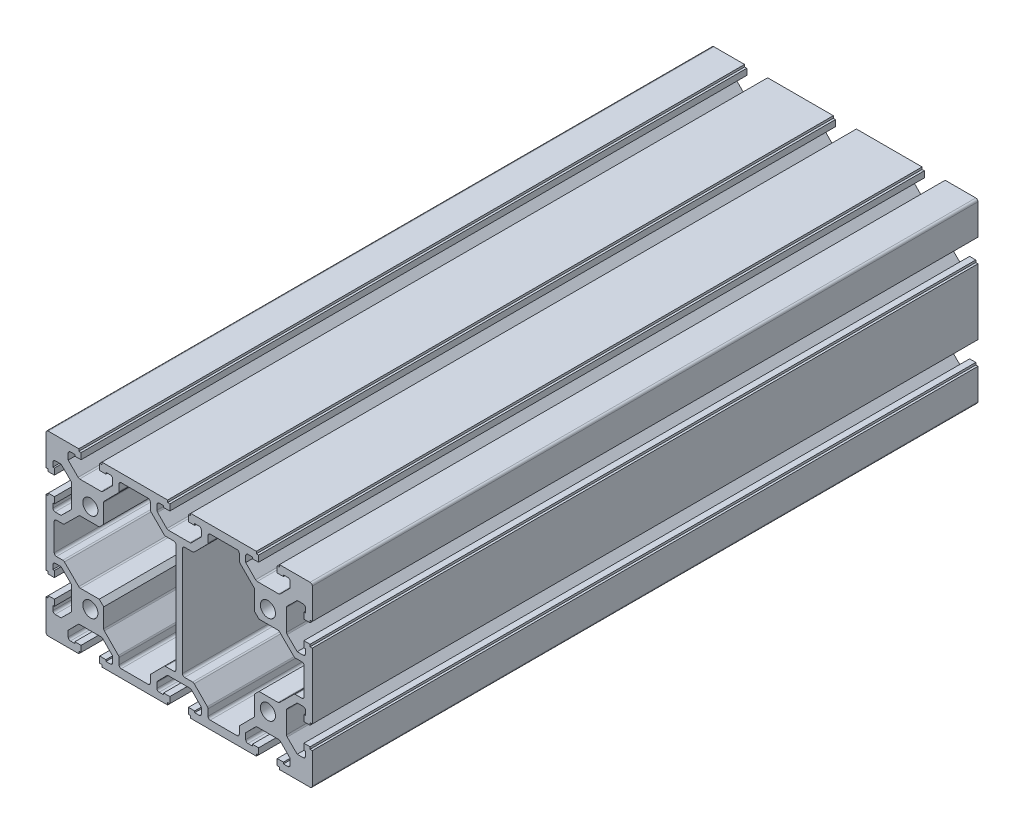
from build123d import *

# Parameters (mm, degrees)
MODEL_R         = 3.4
EXTRUDE_1_DEPTH = 300


with BuildPart() as part:
    # Model → Extrude 1 (new body)
    with BuildSketch(Plane.XY):
        with BuildLine():
            Line((1924.335469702, 1988.284523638), (1929.168185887, 1988.284523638))
            Line((1929.168185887, 1988.284523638), (1934.000902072, 1988.284523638))
            ThreePointArc((1934.000902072, 1988.284523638), (1934.386002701, 1988.207398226), (1934.711701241, 1987.987918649))
            Line((1934.711701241, 1987.987918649), (1938.878985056, 1983.776768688))
            ThreePointArc((1938.878985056, 1983.776768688), (1939.093064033, 1983.45363729), (1939.168185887, 1983.073373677))
            Line((1939.168185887, 1983.073373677), (1939.168185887, 1980.784523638))
            ThreePointArc((1939.168185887, 1980.784523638), (1938.875292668, 1980.077416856), (1938.168185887, 1979.784523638))
            Line((1938.168185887, 1979.784523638), (1936.168185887, 1979.784523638))
            Line((1936.168185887, 1979.784523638), (1936.168185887, 1980.484523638))
            Line((1936.168185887, 1980.484523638), (1933.368185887, 1980.484523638))
            Line((1933.368185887, 1980.484523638), (1933.368185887, 1977.684523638))
            Line((1933.368185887, 1977.684523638), (1934.368185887, 1977.684523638))
            Line((1934.368185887, 1977.684523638), (1934.368185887, 1976.684523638))
            Line((1934.368185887, 1976.684523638), (1963.968185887, 1976.684523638))
            Line((1963.968185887, 1976.684523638), (1963.968185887, 1977.684523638))
            Line((1963.968185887, 1977.684523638), (1964.968185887, 1977.684523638))
            Line((1964.968185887, 1977.684523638), (1964.968185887, 1980.484523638))
            Line((1964.968185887, 1980.484523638), (1962.168185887, 1980.484523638))
            Line((1962.168185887, 1980.484523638), (1962.168185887, 1979.784523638))
            Line((1962.168185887, 1979.784523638), (1960.168185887, 1979.784523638))
            ThreePointArc((1960.168185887, 1979.784523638), (1959.461079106, 1980.077416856), (1959.168185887, 1980.784523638))
            Line((1959.168185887, 1980.784523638), (1959.168185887, 1983.484523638))
            Line((1959.168185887, 1983.484523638), (1963.624670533, 1987.987918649))
            ThreePointArc((1963.624670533, 1987.987918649), (1963.950369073, 1988.207398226), (1964.335469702, 1988.284523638))
            Line((1964.335469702, 1988.284523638), (1969.168185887, 1988.284523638))
            Line((1969.168185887, 1988.284523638), (1974.000902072, 1988.284523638))
            ThreePointArc((1974.000902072, 1988.284523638), (1974.386002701, 1988.207398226), (1974.711701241, 1987.987918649))
            Line((1974.711701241, 1987.987918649), (1979.168185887, 1983.484523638))
            Line((1979.168185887, 1983.484523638), (1979.168185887, 1980.784523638))
            ThreePointArc((1979.168185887, 1980.784523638), (1978.875292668, 1980.077416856), (1978.168185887, 1979.784523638))
            Line((1978.168185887, 1979.784523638), (1976.168185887, 1979.784523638))
            Line((1976.168185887, 1979.784523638), (1976.168185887, 1980.484523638))
            Line((1976.168185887, 1980.484523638), (1973.368185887, 1980.484523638))
            Line((1973.368185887, 1980.484523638), (1973.368185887, 1977.684523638))
            Line((1973.368185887, 1977.684523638), (1974.368185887, 1977.684523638))
            Line((1974.368185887, 1977.684523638), (1974.368185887, 1976.684523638))
            Line((1974.368185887, 1976.684523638), (1988.168185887, 1976.684523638))
            ThreePointArc((1988.168185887, 1976.684523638), (1988.875292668, 1976.977416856), (1989.168185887, 1977.684523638))
            Line((1989.168185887, 1977.684523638), (1989.168185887, 1991.484523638))
            Line((1989.168185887, 1991.484523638), (1988.168185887, 1991.484523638))
            Line((1988.168185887, 1991.484523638), (1988.168185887, 1992.484523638))
            Line((1988.168185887, 1992.484523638), (1985.368185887, 1992.484523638))
            Line((1985.368185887, 1992.484523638), (1985.368185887, 1989.684523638))
            Line((1985.368185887, 1989.684523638), (1986.068185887, 1989.684523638))
            Line((1986.068185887, 1989.684523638), (1986.068185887, 1987.684523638))
            ThreePointArc((1986.068185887, 1987.684523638), (1985.775292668, 1986.977416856), (1985.068185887, 1986.684523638))
            Line((1985.068185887, 1986.684523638), (1982.368185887, 1986.684523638))
            Line((1982.368185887, 1986.684523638), (1977.864790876, 1991.141008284))
            ThreePointArc((1977.864790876, 1991.141008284), (1977.645311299, 1991.466706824), (1977.568185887, 1991.851807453))
            Line((1977.568185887, 1991.851807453), (1977.568185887, 1996.684523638))
            Line((1977.568185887, 1996.684523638), (1977.568185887, 2001.517239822))
            ThreePointArc((1977.568185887, 2001.517239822), (1977.645311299, 2001.902340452), (1977.864790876, 2002.228038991))
            Line((1977.864790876, 2002.228038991), (1982.368185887, 2006.684523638))
            Line((1982.368185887, 2006.684523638), (1985.068185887, 2006.684523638))
            ThreePointArc((1985.068185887, 2006.684523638), (1985.775292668, 2006.391630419), (1986.068185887, 2005.684523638))
            Line((1986.068185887, 2005.684523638), (1986.068185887, 2003.684523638))
            Line((1986.068185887, 2003.684523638), (1985.368185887, 2003.684523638))
            Line((1985.368185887, 2003.684523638), (1985.368185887, 2000.884523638))
            Line((1985.368185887, 2000.884523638), (1988.168185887, 2000.884523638))
            Line((1988.168185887, 2000.884523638), (1988.168185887, 2001.884523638))
            Line((1988.168185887, 2001.884523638), (1989.168185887, 2001.884523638))
            Line((1989.168185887, 2001.884523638), (1989.168185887, 2016.684523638))
            Line((1989.168185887, 2016.684523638), (1989.168185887, 2031.484523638))
            Line((1989.168185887, 2031.484523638), (1988.168185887, 2031.484523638))
            Line((1988.168185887, 2031.484523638), (1988.168185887, 2032.484523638))
            Line((1988.168185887, 2032.484523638), (1985.368185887, 2032.484523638))
            Line((1985.368185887, 2032.484523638), (1985.368185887, 2029.684523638))
            Line((1985.368185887, 2029.684523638), (1986.068185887, 2029.684523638))
            Line((1986.068185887, 2029.684523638), (1986.068185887, 2027.684523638))
            ThreePointArc((1986.068185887, 2027.684523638), (1985.775292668, 2026.977416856), (1985.068185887, 2026.684523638))
            Line((1985.068185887, 2026.684523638), (1982.368185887, 2026.684523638))
            Line((1982.368185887, 2026.684523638), (1977.864790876, 2031.141008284))
            ThreePointArc((1977.864790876, 2031.141008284), (1977.645311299, 2031.466706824), (1977.568185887, 2031.851807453))
            Line((1977.568185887, 2031.851807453), (1977.568185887, 2036.684523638))
            Line((1977.568185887, 2036.684523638), (1977.568185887, 2041.517239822))
            ThreePointArc((1977.568185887, 2041.517239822), (1977.645311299, 2041.902340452), (1977.864790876, 2042.228038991))
            Line((1977.864790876, 2042.228038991), (1982.368185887, 2046.684523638))
            Line((1982.368185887, 2046.684523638), (1985.068185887, 2046.684523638))
            ThreePointArc((1985.068185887, 2046.684523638), (1985.775292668, 2046.391630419), (1986.068185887, 2045.684523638))
            Line((1986.068185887, 2045.684523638), (1986.068185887, 2043.684523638))
            Line((1986.068185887, 2043.684523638), (1985.368185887, 2043.684523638))
            Line((1985.368185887, 2043.684523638), (1985.368185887, 2040.884523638))
            Line((1985.368185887, 2040.884523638), (1988.168185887, 2040.884523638))
            Line((1988.168185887, 2040.884523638), (1988.168185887, 2041.884523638))
            Line((1988.168185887, 2041.884523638), (1989.168185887, 2041.884523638))
            Line((1989.168185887, 2041.884523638), (1989.168185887, 2055.684523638))
            ThreePointArc((1989.168185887, 2055.684523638), (1988.875292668, 2056.391630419), (1988.168185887, 2056.684523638))
            Line((1988.168185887, 2056.684523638), (1974.368185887, 2056.684523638))
            Line((1974.368185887, 2056.684523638), (1974.368185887, 2055.684523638))
            Line((1974.368185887, 2055.684523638), (1973.368185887, 2055.684523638))
            Line((1973.368185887, 2055.684523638), (1973.368185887, 2052.884523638))
            Line((1973.368185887, 2052.884523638), (1976.168185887, 2052.884523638))
            Line((1976.168185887, 2052.884523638), (1976.168185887, 2053.584523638))
            Line((1976.168185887, 2053.584523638), (1978.168185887, 2053.584523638))
            ThreePointArc((1978.168185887, 2053.584523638), (1978.875292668, 2053.291630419), (1979.168185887, 2052.584523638))
            Line((1979.168185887, 2052.584523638), (1979.168185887, 2049.884523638))
            Line((1979.168185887, 2049.884523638), (1974.711701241, 2045.381128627))
            ThreePointArc((1974.711701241, 2045.381128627), (1974.386002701, 2045.16164905), (1974.000902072, 2045.084523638))
            Line((1974.000902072, 2045.084523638), (1969.168185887, 2045.084523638))
            Line((1969.168185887, 2045.084523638), (1964.335469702, 2045.084523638))
            ThreePointArc((1964.335469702, 2045.084523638), (1963.950369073, 2045.16164905), (1963.624670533, 2045.381128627))
            Line((1963.624670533, 2045.381128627), (1959.168185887, 2049.884523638))
            Line((1959.168185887, 2049.884523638), (1959.168185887, 2052.584523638))
            ThreePointArc((1959.168185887, 2052.584523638), (1959.461079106, 2053.291630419), (1960.168185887, 2053.584523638))
            Line((1960.168185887, 2053.584523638), (1962.168185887, 2053.584523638))
            Line((1962.168185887, 2053.584523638), (1962.168185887, 2052.884523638))
            Line((1962.168185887, 2052.884523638), (1964.968185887, 2052.884523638))
            Line((1964.968185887, 2052.884523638), (1964.968185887, 2055.684523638))
            Line((1964.968185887, 2055.684523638), (1963.968185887, 2055.684523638))
            Line((1963.968185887, 2055.684523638), (1963.968185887, 2056.684523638))
            Line((1963.968185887, 2056.684523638), (1934.368185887, 2056.684523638))
            Line((1934.368185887, 2056.684523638), (1934.368185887, 2055.684523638))
            Line((1934.368185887, 2055.684523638), (1933.368185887, 2055.684523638))
            Line((1933.368185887, 2055.684523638), (1933.368185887, 2052.884523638))
            Line((1933.368185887, 2052.884523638), (1936.168185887, 2052.884523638))
            Line((1936.168185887, 2052.884523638), (1936.168185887, 2053.584523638))
            Line((1936.168185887, 2053.584523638), (1938.168185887, 2053.584523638))
            ThreePointArc((1938.168185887, 2053.584523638), (1938.875292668, 2053.291630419), (1939.168185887, 2052.584523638))
            Line((1939.168185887, 2052.584523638), (1939.168185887, 2050.295673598))
            ThreePointArc((1939.168185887, 2050.295673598), (1939.093064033, 2049.915409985), (1938.878985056, 2049.592278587))
            Line((1938.878985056, 2049.592278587), (1934.711701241, 2045.381128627))
            ThreePointArc((1934.711701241, 2045.381128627), (1934.386002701, 2045.16164905), (1934.000902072, 2045.084523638))
            Line((1934.000902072, 2045.084523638), (1929.168185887, 2045.084523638))
            Line((1929.168185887, 2045.084523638), (1924.335469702, 2045.084523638))
            ThreePointArc((1924.335469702, 2045.084523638), (1923.950369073, 2045.16164905), (1923.624670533, 2045.381128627))
            Line((1923.624670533, 2045.381128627), (1919.457386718, 2049.592278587))
            ThreePointArc((1919.457386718, 2049.592278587), (1919.243307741, 2049.915409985), (1919.168185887, 2050.295673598))
            Line((1919.168185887, 2050.295673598), (1919.168185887, 2052.584523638))
            ThreePointArc((1919.168185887, 2052.584523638), (1919.461079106, 2053.291630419), (1920.168185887, 2053.584523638))
            Line((1920.168185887, 2053.584523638), (1922.168185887, 2053.584523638))
            Line((1922.168185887, 2053.584523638), (1922.168185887, 2052.884523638))
            Line((1922.168185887, 2052.884523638), (1924.968185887, 2052.884523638))
            Line((1924.968185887, 2052.884523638), (1924.968185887, 2055.684523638))
            Line((1924.968185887, 2055.684523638), (1923.968185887, 2055.684523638))
            Line((1923.968185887, 2055.684523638), (1923.968185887, 2056.684523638))
            Line((1923.968185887, 2056.684523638), (1894.368185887, 2056.684523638))
            Line((1894.368185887, 2056.684523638), (1894.368185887, 2055.684523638))
            Line((1894.368185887, 2055.684523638), (1893.368185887, 2055.684523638))
            Line((1893.368185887, 2055.684523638), (1893.368185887, 2052.884523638))
            Line((1893.368185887, 2052.884523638), (1896.168185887, 2052.884523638))
            Line((1896.168185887, 2052.884523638), (1896.168185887, 2053.584523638))
            Line((1896.168185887, 2053.584523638), (1898.168185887, 2053.584523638))
            ThreePointArc((1898.168185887, 2053.584523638), (1898.875292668, 2053.291630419), (1899.168185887, 2052.584523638))
            Line((1899.168185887, 2052.584523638), (1899.168185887, 2049.884523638))
            Line((1899.168185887, 2049.884523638), (1894.711701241, 2045.381128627))
            ThreePointArc((1894.711701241, 2045.381128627), (1894.386002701, 2045.16164905), (1894.000902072, 2045.084523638))
            Line((1894.000902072, 2045.084523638), (1889.168185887, 2045.084523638))
            Line((1889.168185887, 2045.084523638), (1884.335469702, 2045.084523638))
            ThreePointArc((1884.335469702, 2045.084523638), (1883.950369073, 2045.16164905), (1883.624670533, 2045.381128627))
            Line((1883.624670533, 2045.381128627), (1879.168185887, 2049.884523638))
            Line((1879.168185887, 2049.884523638), (1879.168185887, 2052.584523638))
            ThreePointArc((1879.168185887, 2052.584523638), (1879.461079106, 2053.291630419), (1880.168185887, 2053.584523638))
            Line((1880.168185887, 2053.584523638), (1882.168185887, 2053.584523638))
            Line((1882.168185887, 2053.584523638), (1882.168185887, 2052.884523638))
            Line((1882.168185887, 2052.884523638), (1884.968185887, 2052.884523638))
            Line((1884.968185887, 2052.884523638), (1884.968185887, 2055.684523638))
            Line((1884.968185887, 2055.684523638), (1883.968185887, 2055.684523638))
            Line((1883.968185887, 2055.684523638), (1883.968185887, 2056.684523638))
            Line((1883.968185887, 2056.684523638), (1870.168185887, 2056.684523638))
            ThreePointArc((1870.168185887, 2056.684523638), (1869.461079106, 2056.391630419), (1869.168185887, 2055.684523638))
            Line((1869.168185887, 2055.684523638), (1869.168185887, 2041.884523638))
            Line((1869.168185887, 2041.884523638), (1870.168185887, 2041.884523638))
            Line((1870.168185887, 2041.884523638), (1870.168185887, 2040.884523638))
            Line((1870.168185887, 2040.884523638), (1872.968185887, 2040.884523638))
            Line((1872.968185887, 2040.884523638), (1872.968185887, 2043.684523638))
            Line((1872.968185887, 2043.684523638), (1872.268185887, 2043.684523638))
            Line((1872.268185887, 2043.684523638), (1872.268185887, 2045.684523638))
            ThreePointArc((1872.268185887, 2045.684523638), (1872.561079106, 2046.391630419), (1873.268185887, 2046.684523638))
            Line((1873.268185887, 2046.684523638), (1875.968185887, 2046.684523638))
            Line((1875.968185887, 2046.684523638), (1880.471580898, 2042.228038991))
            ThreePointArc((1880.471580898, 2042.228038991), (1880.691060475, 2041.902340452), (1880.768185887, 2041.517239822))
            Line((1880.768185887, 2041.517239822), (1880.768185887, 2036.684523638))
            Line((1880.768185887, 2036.684523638), (1880.768185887, 2031.851807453))
            ThreePointArc((1880.768185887, 2031.851807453), (1880.691060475, 2031.466706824), (1880.471580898, 2031.141008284))
            Line((1880.471580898, 2031.141008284), (1875.968185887, 2026.684523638))
            Line((1875.968185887, 2026.684523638), (1873.268185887, 2026.684523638))
            ThreePointArc((1873.268185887, 2026.684523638), (1872.561079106, 2026.977416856), (1872.268185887, 2027.684523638))
            Line((1872.268185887, 2027.684523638), (1872.268185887, 2029.684523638))
            Line((1872.268185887, 2029.684523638), (1872.968185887, 2029.684523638))
            Line((1872.968185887, 2029.684523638), (1872.968185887, 2032.484523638))
            Line((1872.968185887, 2032.484523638), (1870.168185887, 2032.484523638))
            Line((1870.168185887, 2032.484523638), (1870.168185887, 2031.484523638))
            Line((1870.168185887, 2031.484523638), (1869.168185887, 2031.484523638))
            Line((1869.168185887, 2031.484523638), (1869.168185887, 2016.684523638))
            Line((1869.168185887, 2016.684523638), (1869.168185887, 2001.884523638))
            Line((1869.168185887, 2001.884523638), (1870.168185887, 2001.884523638))
            Line((1870.168185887, 2001.884523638), (1870.168185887, 2000.884523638))
            Line((1870.168185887, 2000.884523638), (1872.968185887, 2000.884523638))
            Line((1872.968185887, 2000.884523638), (1872.968185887, 2003.684523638))
            Line((1872.968185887, 2003.684523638), (1872.268185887, 2003.684523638))
            Line((1872.268185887, 2003.684523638), (1872.268185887, 2005.684523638))
            ThreePointArc((1872.268185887, 2005.684523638), (1872.561079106, 2006.391630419), (1873.268185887, 2006.684523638))
            Line((1873.268185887, 2006.684523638), (1875.968185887, 2006.684523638))
            Line((1875.968185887, 2006.684523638), (1880.471580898, 2002.228038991))
            ThreePointArc((1880.471580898, 2002.228038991), (1880.691060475, 2001.902340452), (1880.768185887, 2001.517239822))
            Line((1880.768185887, 2001.517239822), (1880.768185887, 1996.684523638))
            Line((1880.768185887, 1996.684523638), (1880.768185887, 1991.851807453))
            ThreePointArc((1880.768185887, 1991.851807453), (1880.691060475, 1991.466706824), (1880.471580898, 1991.141008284))
            Line((1880.471580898, 1991.141008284), (1875.968185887, 1986.684523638))
            Line((1875.968185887, 1986.684523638), (1873.268185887, 1986.684523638))
            ThreePointArc((1873.268185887, 1986.684523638), (1872.561079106, 1986.977416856), (1872.268185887, 1987.684523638))
            Line((1872.268185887, 1987.684523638), (1872.268185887, 1989.684523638))
            Line((1872.268185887, 1989.684523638), (1872.968185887, 1989.684523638))
            Line((1872.968185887, 1989.684523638), (1872.968185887, 1992.484523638))
            Line((1872.968185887, 1992.484523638), (1870.168185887, 1992.484523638))
            Line((1870.168185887, 1992.484523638), (1870.168185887, 1991.484523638))
            Line((1870.168185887, 1991.484523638), (1869.168185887, 1991.484523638))
            Line((1869.168185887, 1991.484523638), (1869.168185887, 1977.684523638))
            ThreePointArc((1869.168185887, 1977.684523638), (1869.461079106, 1976.977416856), (1870.168185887, 1976.684523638))
            Line((1870.168185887, 1976.684523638), (1883.968185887, 1976.684523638))
            Line((1883.968185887, 1976.684523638), (1883.968185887, 1977.684523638))
            Line((1883.968185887, 1977.684523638), (1884.968185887, 1977.684523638))
            Line((1884.968185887, 1977.684523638), (1884.968185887, 1980.484523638))
            Line((1884.968185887, 1980.484523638), (1882.168185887, 1980.484523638))
            Line((1882.168185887, 1980.484523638), (1882.168185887, 1979.784523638))
            Line((1882.168185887, 1979.784523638), (1880.168185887, 1979.784523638))
            ThreePointArc((1880.168185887, 1979.784523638), (1879.461079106, 1980.077416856), (1879.168185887, 1980.784523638))
            Line((1879.168185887, 1980.784523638), (1879.168185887, 1983.484523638))
            Line((1879.168185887, 1983.484523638), (1883.624670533, 1987.987918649))
            ThreePointArc((1883.624670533, 1987.987918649), (1883.950369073, 1988.207398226), (1884.335469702, 1988.284523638))
            Line((1884.335469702, 1988.284523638), (1889.168185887, 1988.284523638))
            Line((1889.168185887, 1988.284523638), (1894.000902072, 1988.284523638))
            ThreePointArc((1894.000902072, 1988.284523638), (1894.386002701, 1988.207398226), (1894.711701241, 1987.987918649))
            Line((1894.711701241, 1987.987918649), (1899.168185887, 1983.484523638))
            Line((1899.168185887, 1983.484523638), (1899.168185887, 1980.784523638))
            ThreePointArc((1899.168185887, 1980.784523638), (1898.875292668, 1980.077416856), (1898.168185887, 1979.784523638))
            Line((1898.168185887, 1979.784523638), (1896.168185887, 1979.784523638))
            Line((1896.168185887, 1979.784523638), (1896.168185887, 1980.484523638))
            Line((1896.168185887, 1980.484523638), (1893.368185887, 1980.484523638))
            Line((1893.368185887, 1980.484523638), (1893.368185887, 1977.684523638))
            Line((1893.368185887, 1977.684523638), (1894.368185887, 1977.684523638))
            Line((1894.368185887, 1977.684523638), (1894.368185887, 1976.684523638))
            Line((1894.368185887, 1976.684523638), (1923.968185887, 1976.684523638))
            Line((1923.968185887, 1976.684523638), (1923.968185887, 1977.684523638))
            Line((1923.968185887, 1977.684523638), (1924.968185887, 1977.684523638))
            Line((1924.968185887, 1977.684523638), (1924.968185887, 1980.484523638))
            Line((1924.968185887, 1980.484523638), (1922.168185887, 1980.484523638))
            Line((1922.168185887, 1980.484523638), (1922.168185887, 1979.784523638))
            Line((1922.168185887, 1979.784523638), (1920.168185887, 1979.784523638))
            ThreePointArc((1920.168185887, 1979.784523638), (1919.461079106, 1980.077416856), (1919.168185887, 1980.784523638))
            Line((1919.168185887, 1980.784523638), (1919.168185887, 1983.073373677))
            ThreePointArc((1919.168185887, 1983.073373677), (1919.243307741, 1983.45363729), (1919.457386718, 1983.776768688))
            Line((1919.457386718, 1983.776768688), (1923.624670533, 1987.987918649))
            ThreePointArc((1923.624670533, 1987.987918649), (1923.950369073, 1988.207398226), (1924.335469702, 1988.284523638))
        make_face()
        with Locations((1969.168185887, 2036.684523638)):
            Circle(MODEL_R, mode=Mode.SUBTRACT)
        with Locations((1889.168185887, 2036.684523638)):
            Circle(MODEL_R, mode=Mode.SUBTRACT)
        with Locations((1969.168185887, 1996.684523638)):
            Circle(MODEL_R, mode=Mode.SUBTRACT)
        with Locations((1889.168185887, 1996.684523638)):
            Circle(MODEL_R, mode=Mode.SUBTRACT)
        with BuildLine():
            Line((1930.618185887, 2016.684523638), (1930.618185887, 1992.284523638))
            ThreePointArc((1930.618185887, 1992.284523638), (1930.911079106, 1991.577416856), (1931.618185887, 1991.284523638))
            Line((1931.618185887, 1991.284523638), (1935.252753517, 1991.284523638))
            ThreePointArc((1935.252753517, 1991.284523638), (1935.637854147, 1991.207398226), (1935.963552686, 1990.987918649))
            Line((1935.963552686, 1990.987918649), (1941.878985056, 1985.01021857))
            ThreePointArc((1941.878985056, 1985.01021857), (1942.093064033, 1984.687087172), (1942.168185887, 1984.306823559))
            Line((1942.168185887, 1984.306823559), (1942.168185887, 1981.384523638))
            ThreePointArc((1942.168185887, 1981.384523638), (1942.461079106, 1980.677416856), (1943.168185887, 1980.384523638))
            Line((1943.168185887, 1980.384523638), (1955.268185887, 1980.384523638))
            ThreePointArc((1955.268185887, 1980.384523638), (1955.975292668, 1980.677416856), (1956.268185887, 1981.384523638))
            Line((1956.268185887, 1981.384523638), (1956.268185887, 1984.265708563))
            ThreePointArc((1956.268185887, 1984.265708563), (1956.343307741, 1984.645972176), (1956.557386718, 1984.969103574))
            Line((1956.557386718, 1984.969103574), (1962.878985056, 1991.357245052))
            ThreePointArc((1962.878985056, 1991.357245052), (1963.093064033, 1991.68037645), (1963.168185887, 1992.060640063))
            Line((1963.168185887, 1992.060640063), (1963.168185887, 2000.584523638))
            Line((1963.168185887, 2000.584523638), (1965.168185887, 2002.584523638))
            Line((1965.168185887, 2002.584523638), (1973.69101683, 2002.584523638))
            ThreePointArc((1973.69101683, 2002.584523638), (1974.071280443, 2002.659645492), (1974.394411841, 2002.873724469))
            Line((1974.394411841, 2002.873724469), (1980.883605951, 2009.295322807))
            ThreePointArc((1980.883605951, 2009.295322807), (1981.206737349, 2009.509401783), (1981.587000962, 2009.584523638))
            Line((1981.587000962, 2009.584523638), (1984.468185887, 2009.584523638))
            ThreePointArc((1984.468185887, 2009.584523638), (1985.175292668, 2009.877416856), (1985.468185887, 2010.584523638))
            Line((1985.468185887, 2010.584523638), (1985.468185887, 2016.684523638))
            Line((1985.468185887, 2016.684523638), (1985.468185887, 2022.784523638))
            ThreePointArc((1985.468185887, 2022.784523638), (1985.175292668, 2023.491630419), (1984.468185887, 2023.784523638))
            Line((1984.468185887, 2023.784523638), (1981.587000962, 2023.784523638))
            ThreePointArc((1981.587000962, 2023.784523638), (1981.206737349, 2023.859645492), (1980.883605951, 2024.073724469))
            Line((1980.883605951, 2024.073724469), (1974.394411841, 2030.495322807))
            ThreePointArc((1974.394411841, 2030.495322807), (1974.071280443, 2030.709401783), (1973.69101683, 2030.784523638))
            Line((1973.69101683, 2030.784523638), (1965.168185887, 2030.784523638))
            Line((1965.168185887, 2030.784523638), (1963.168185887, 2032.784523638))
            Line((1963.168185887, 2032.784523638), (1963.168185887, 2041.308407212))
            ThreePointArc((1963.168185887, 2041.308407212), (1963.093064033, 2041.688670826), (1962.878985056, 2042.011802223))
            Line((1962.878985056, 2042.011802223), (1956.557386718, 2048.399943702))
            ThreePointArc((1956.557386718, 2048.399943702), (1956.343307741, 2048.723075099), (1956.268185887, 2049.103338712))
            Line((1956.268185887, 2049.103338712), (1956.268185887, 2051.984523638))
            ThreePointArc((1956.268185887, 2051.984523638), (1955.975292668, 2052.691630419), (1955.268185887, 2052.984523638))
            Line((1955.268185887, 2052.984523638), (1943.168185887, 2052.984523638))
            ThreePointArc((1943.168185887, 2052.984523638), (1942.461079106, 2052.691630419), (1942.168185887, 2051.984523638))
            Line((1942.168185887, 2051.984523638), (1942.168185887, 2049.062223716))
            ThreePointArc((1942.168185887, 2049.062223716), (1942.093064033, 2048.681960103), (1941.878985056, 2048.358828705))
            Line((1941.878985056, 2048.358828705), (1935.963552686, 2042.381128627))
            ThreePointArc((1935.963552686, 2042.381128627), (1935.637854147, 2042.16164905), (1935.252753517, 2042.084523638))
            Line((1935.252753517, 2042.084523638), (1931.618185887, 2042.084523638))
            ThreePointArc((1931.618185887, 2042.084523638), (1930.911079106, 2041.791630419), (1930.618185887, 2041.084523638))
            Line((1930.618185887, 2041.084523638), (1930.618185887, 2016.684523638))
        make_face(mode=Mode.SUBTRACT)
        with BuildLine():
            Line((1927.718185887, 1992.284523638), (1927.718185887, 2016.684523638))
            Line((1927.718185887, 2016.684523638), (1927.718185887, 2041.084523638))
            ThreePointArc((1927.718185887, 2041.084523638), (1927.425292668, 2041.791630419), (1926.718185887, 2042.084523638))
            Line((1926.718185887, 2042.084523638), (1923.083618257, 2042.084523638))
            ThreePointArc((1923.083618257, 2042.084523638), (1922.698517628, 2042.16164905), (1922.372819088, 2042.381128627))
            Line((1922.372819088, 2042.381128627), (1916.457386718, 2048.358828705))
            ThreePointArc((1916.457386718, 2048.358828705), (1916.243307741, 2048.681960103), (1916.168185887, 2049.062223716))
            Line((1916.168185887, 2049.062223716), (1916.168185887, 2051.984523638))
            ThreePointArc((1916.168185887, 2051.984523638), (1915.875292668, 2052.691630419), (1915.168185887, 2052.984523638))
            Line((1915.168185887, 2052.984523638), (1903.068185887, 2052.984523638))
            ThreePointArc((1903.068185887, 2052.984523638), (1902.361079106, 2052.691630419), (1902.068185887, 2051.984523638))
            Line((1902.068185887, 2051.984523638), (1902.068185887, 2049.103338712))
            ThreePointArc((1902.068185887, 2049.103338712), (1901.993064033, 2048.723075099), (1901.778985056, 2048.399943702))
            Line((1901.778985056, 2048.399943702), (1895.457386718, 2042.011802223))
            ThreePointArc((1895.457386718, 2042.011802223), (1895.243307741, 2041.688670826), (1895.168185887, 2041.308407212))
            Line((1895.168185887, 2041.308407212), (1895.168185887, 2032.784523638))
            Line((1895.168185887, 2032.784523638), (1893.168185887, 2030.784523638))
            Line((1893.168185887, 2030.784523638), (1884.645354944, 2030.784523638))
            ThreePointArc((1884.645354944, 2030.784523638), (1884.265091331, 2030.709401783), (1883.941959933, 2030.495322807))
            Line((1883.941959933, 2030.495322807), (1877.452765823, 2024.073724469))
            ThreePointArc((1877.452765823, 2024.073724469), (1877.129634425, 2023.859645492), (1876.749370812, 2023.784523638))
            Line((1876.749370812, 2023.784523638), (1873.868185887, 2023.784523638))
            ThreePointArc((1873.868185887, 2023.784523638), (1873.161079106, 2023.491630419), (1872.868185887, 2022.784523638))
            Line((1872.868185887, 2022.784523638), (1872.868185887, 2016.684523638))
            Line((1872.868185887, 2016.684523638), (1872.868185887, 2010.584523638))
            ThreePointArc((1872.868185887, 2010.584523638), (1873.161079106, 2009.877416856), (1873.868185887, 2009.584523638))
            Line((1873.868185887, 2009.584523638), (1876.749370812, 2009.584523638))
            ThreePointArc((1876.749370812, 2009.584523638), (1877.129634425, 2009.509401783), (1877.452765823, 2009.295322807))
            Line((1877.452765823, 2009.295322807), (1883.941959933, 2002.873724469))
            ThreePointArc((1883.941959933, 2002.873724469), (1884.265091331, 2002.659645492), (1884.645354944, 2002.584523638))
            Line((1884.645354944, 2002.584523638), (1893.168185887, 2002.584523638))
            Line((1893.168185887, 2002.584523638), (1895.168185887, 2000.584523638))
            Line((1895.168185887, 2000.584523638), (1895.168185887, 1992.060640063))
            ThreePointArc((1895.168185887, 1992.060640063), (1895.243307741, 1991.68037645), (1895.457386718, 1991.357245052))
            Line((1895.457386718, 1991.357245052), (1901.778985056, 1984.969103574))
            ThreePointArc((1901.778985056, 1984.969103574), (1901.993064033, 1984.645972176), (1902.068185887, 1984.265708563))
            Line((1902.068185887, 1984.265708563), (1902.068185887, 1981.384523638))
            ThreePointArc((1902.068185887, 1981.384523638), (1902.361079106, 1980.677416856), (1903.068185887, 1980.384523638))
            Line((1903.068185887, 1980.384523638), (1915.168185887, 1980.384523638))
            ThreePointArc((1915.168185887, 1980.384523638), (1915.875292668, 1980.677416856), (1916.168185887, 1981.384523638))
            Line((1916.168185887, 1981.384523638), (1916.168185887, 1984.306823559))
            ThreePointArc((1916.168185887, 1984.306823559), (1916.243307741, 1984.687087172), (1916.457386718, 1985.01021857))
            Line((1916.457386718, 1985.01021857), (1922.372819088, 1990.987918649))
            ThreePointArc((1922.372819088, 1990.987918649), (1922.698517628, 1991.207398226), (1923.083618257, 1991.284523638))
            Line((1923.083618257, 1991.284523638), (1926.718185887, 1991.284523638))
            ThreePointArc((1926.718185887, 1991.284523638), (1927.425292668, 1991.577416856), (1927.718185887, 1992.284523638))
        make_face(mode=Mode.SUBTRACT)
    extrude(amount=EXTRUDE_1_DEPTH)


solid = part.part
